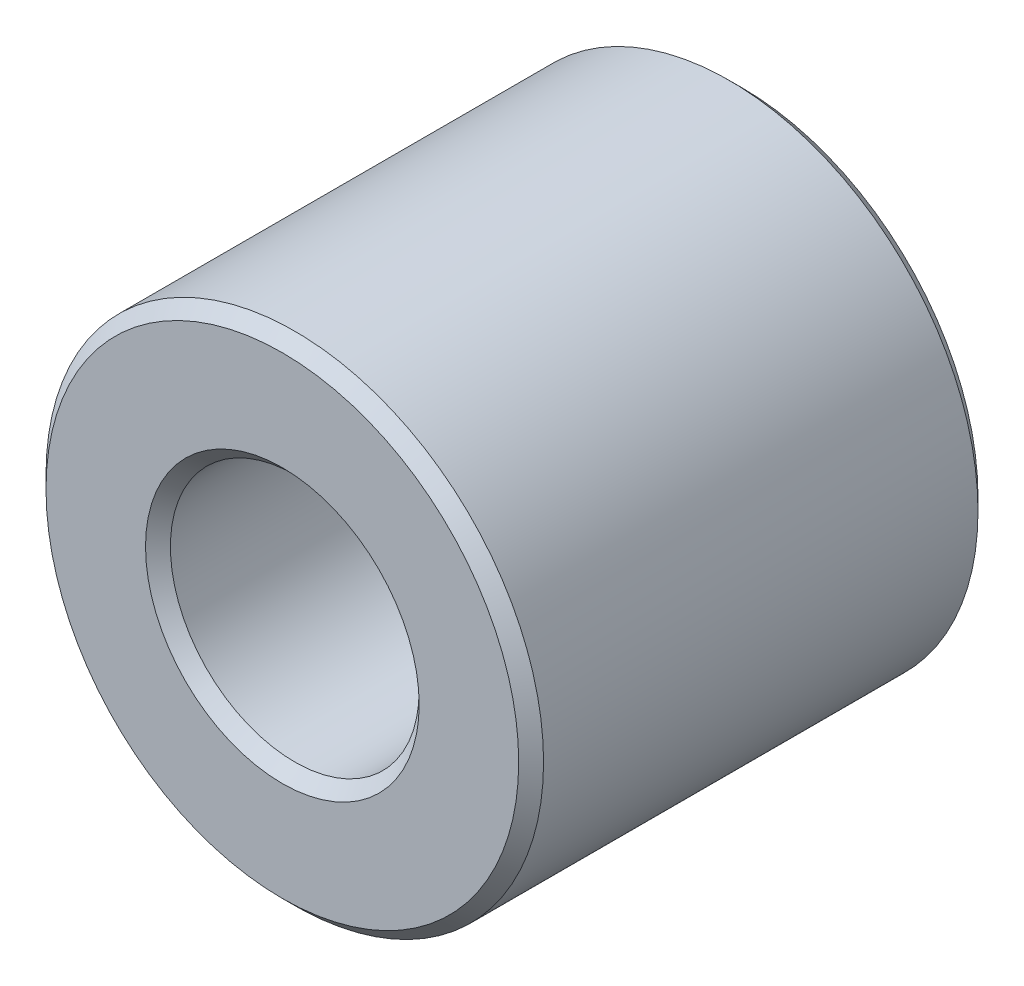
from build123d import *

# Parameters (mm, degrees)
SKETCH1_R           = 13
SKETCH1_R_2         = 6.5
BOSS_EXTRUDE1_DEPTH = 12
CHAMFER1_SIZE       = 0.65


with BuildPart() as part:
    # Sketch1 → Boss-Extrude1 (new, symmetric)
    with BuildSketch(Plane.XY):
        Circle(SKETCH1_R)
        Circle(SKETCH1_R_2, mode=Mode.SUBTRACT)
    extrude(amount=BOSS_EXTRUDE1_DEPTH, both=True)

    # Chamfer1
    chamfer1_edges = [part.edges().sort_by_distance(p)[0] for p in [
        (-13, 0, -12),
        (-13, 0, 12),
        (-6.5, 0, -12),
        (-6.5, 0, 12),
    ]]
    chamfer(chamfer1_edges, length=CHAMFER1_SIZE)


solid = part.part
